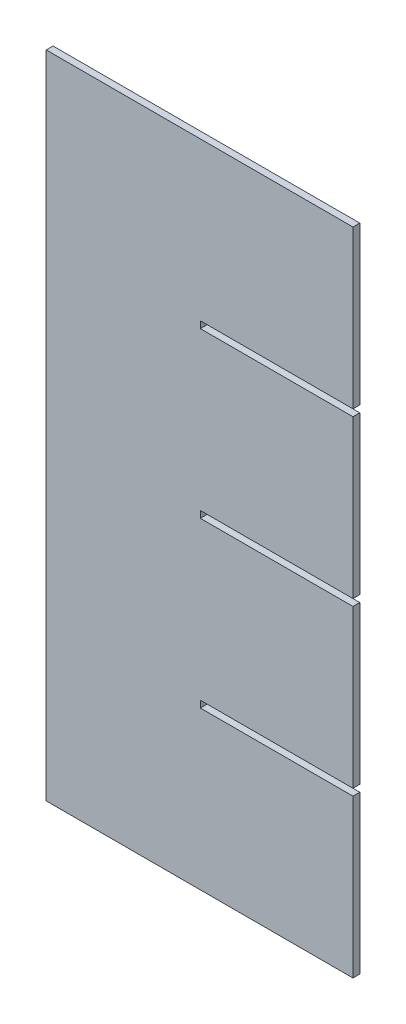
from build123d import *

# Parameters (mm, degrees)
BOSS_EXTRUDE1_DEPTH = 3.556


with BuildPart() as part:
    # Sketch1 → Boss-Extrude1 (new body)
    with BuildSketch(Plane.XY):
        Polygon((0, 0), (160.274, 0), (160.274, 82.296), (80.518, 82.296), (80.518, 85.852), (160.274, 85.852), (160.274, 168.148), (80.518, 168.148), (80.518, 171.704), (160.274, 171.704), (160.274, 254), (80.518, 254), (80.518, 257.556), (160.274, 257.556), (160.274, 339.852), (0, 339.852), align=None)
    extrude(amount=BOSS_EXTRUDE1_DEPTH)


solid = part.part
